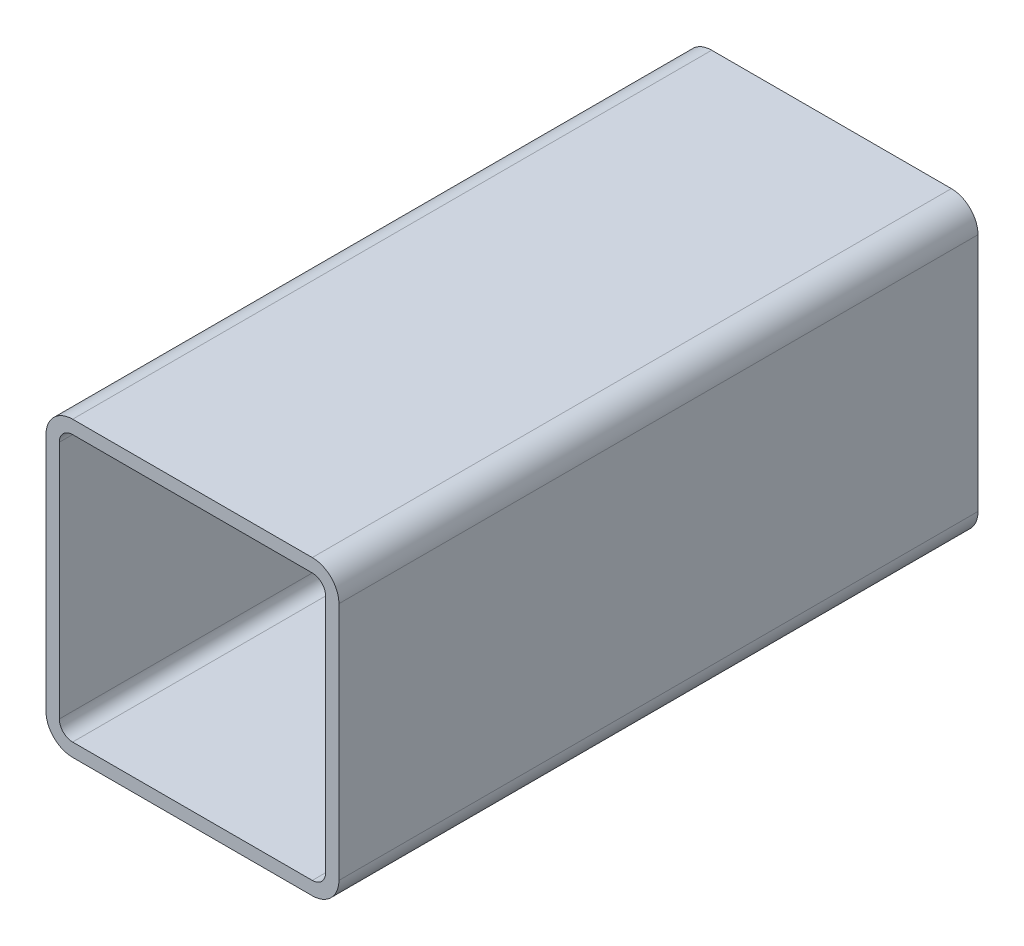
ISO-10303-21;
HEADER;
FILE_DESCRIPTION(('STEP AP214'),'2;1');
FILE_NAME('part.step','',(''),(''),'','','');
FILE_SCHEMA(('AUTOMOTIVE_DESIGN { 1 0 10303 214 1 1 1 1 }'));
ENDSEC;
DATA;
#1=APPLICATION_CONTEXT('core data for automotive mechanical design processes');
#2=APPLICATION_PROTOCOL_DEFINITION('international standard','automotive_design',2000,#1);
#3=PRODUCT_CONTEXT('',#1,'mechanical');
#4=PRODUCT('Part','Part','',(#3));
#5=PRODUCT_RELATED_PRODUCT_CATEGORY('part','',(#4));
#6=PRODUCT_DEFINITION_FORMATION('','',#4);
#7=PRODUCT_DEFINITION_CONTEXT('part definition',#1,'design');
#8=PRODUCT_DEFINITION('design','',#6,#7);
#9=PRODUCT_DEFINITION_SHAPE('','',#8);
#10=(LENGTH_UNIT() NAMED_UNIT(*) SI_UNIT(.MILLI.,.METRE.));
#11=(NAMED_UNIT(*) PLANE_ANGLE_UNIT() SI_UNIT($,.RADIAN.));
#12=(NAMED_UNIT(*) SI_UNIT($,.STERADIAN.) SOLID_ANGLE_UNIT());
#13=UNCERTAINTY_MEASURE_WITH_UNIT(LENGTH_MEASURE(1.E-05),#10,'distance_accuracy_value','');
#14=(GEOMETRIC_REPRESENTATION_CONTEXT(3) GLOBAL_UNCERTAINTY_ASSIGNED_CONTEXT((#13)) GLOBAL_UNIT_ASSIGNED_CONTEXT((#10,
#11,#12)) REPRESENTATION_CONTEXT('',''));
#15=CARTESIAN_POINT('',(0.,0.,0.));
#16=DIRECTION('',(0.,0.,1.));
#17=DIRECTION('',(1.,0.,0.));
#18=AXIS2_PLACEMENT_3D('',#15,#16,#17);
#19=CARTESIAN_POINT('',(13.1542705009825,127.755693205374,304.8));
#20=DIRECTION('',(0.,0.,1.));
#21=DIRECTION('',(1.,0.,0.));
#22=AXIS2_PLACEMENT_3D('',#19,#20,#21);
#23=PLANE('',#22);
#24=CARTESIAN_POINT('',(13.1542705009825,127.755693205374,304.8));
#25=DIRECTION('',(0.,0.,1.));
#26=DIRECTION('',(1.,0.,0.));
#27=AXIS2_PLACEMENT_3D('',#24,#25,#26);
#28=CIRCLE('',#27,12.7);
#29=CARTESIAN_POINT('',(13.1542705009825,140.455693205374,304.8));
#30=VERTEX_POINT('',#29);
#31=CARTESIAN_POINT('',(0.454270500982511,127.755693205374,304.8));
#32=VERTEX_POINT('',#31);
#33=EDGE_CURVE('E211',#30,#32,#28,.T.);
#34=ORIENTED_EDGE('',*,*,#33,.T.);
#35=DIRECTION('',(0.,-1.,0.));
#36=VECTOR('',#35,1.);
#37=CARTESIAN_POINT('',(0.454270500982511,13.4556932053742,304.8));
#38=LINE('',#37,#36);
#39=CARTESIAN_POINT('',(0.454270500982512,13.4556932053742,304.8));
#40=VERTEX_POINT('',#39);
#41=EDGE_CURVE('E214',#32,#40,#38,.T.);
#42=ORIENTED_EDGE('',*,*,#41,.T.);
#43=CARTESIAN_POINT('',(13.1542705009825,13.4556932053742,304.8));
#44=DIRECTION('',(0.,0.,1.));
#45=DIRECTION('',(1.,0.,0.));
#46=AXIS2_PLACEMENT_3D('',#43,#44,#45);
#47=CIRCLE('',#46,12.7);
#48=CARTESIAN_POINT('',(13.1542705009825,0.755693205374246,304.8));
#49=VERTEX_POINT('',#48);
#50=EDGE_CURVE('E217',#40,#49,#47,.T.);
#51=ORIENTED_EDGE('',*,*,#50,.T.);
#52=DIRECTION('',(1.,0.,0.));
#53=VECTOR('',#52,1.);
#54=CARTESIAN_POINT('',(127.454270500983,0.755693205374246,304.8));
#55=LINE('',#54,#53);
#56=CARTESIAN_POINT('',(127.454270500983,0.755693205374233,304.8));
#57=VERTEX_POINT('',#56);
#58=EDGE_CURVE('E219',#49,#57,#55,.T.);
#59=ORIENTED_EDGE('',*,*,#58,.T.);
#60=CARTESIAN_POINT('',(127.454270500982,13.4556932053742,304.8));
#61=DIRECTION('',(0.,0.,1.));
#62=DIRECTION('',(1.,0.,0.));
#63=AXIS2_PLACEMENT_3D('',#60,#61,#62);
#64=CIRCLE('',#63,12.7);
#65=CARTESIAN_POINT('',(140.154270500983,13.4556932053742,304.8));
#66=VERTEX_POINT('',#65);
#67=EDGE_CURVE('E221',#57,#66,#64,.T.);
#68=ORIENTED_EDGE('',*,*,#67,.T.);
#69=DIRECTION('',(0.,1.,0.));
#70=VECTOR('',#69,1.);
#71=CARTESIAN_POINT('',(140.154270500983,127.755693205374,304.8));
#72=LINE('',#71,#70);
#73=CARTESIAN_POINT('',(140.154270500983,127.755693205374,304.8));
#74=VERTEX_POINT('',#73);
#75=EDGE_CURVE('E223',#66,#74,#72,.T.);
#76=ORIENTED_EDGE('',*,*,#75,.T.);
#77=CARTESIAN_POINT('',(127.454270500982,127.755693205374,304.8));
#78=DIRECTION('',(0.,0.,1.));
#79=DIRECTION('',(1.,0.,0.));
#80=AXIS2_PLACEMENT_3D('',#77,#78,#79);
#81=CIRCLE('',#80,12.7);
#82=CARTESIAN_POINT('',(127.454270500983,140.455693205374,304.8));
#83=VERTEX_POINT('',#82);
#84=EDGE_CURVE('E225',#74,#83,#81,.T.);
#85=ORIENTED_EDGE('',*,*,#84,.T.);
#86=DIRECTION('',(-1.,0.,0.));
#87=VECTOR('',#86,1.);
#88=CARTESIAN_POINT('',(13.1542705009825,140.455693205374,304.8));
#89=LINE('',#88,#87);
#90=EDGE_CURVE('E227',#83,#30,#89,.T.);
#91=ORIENTED_EDGE('',*,*,#90,.T.);
#92=EDGE_LOOP('',(#34,#42,#51,#59,#68,#76,#85,#91));
#93=FACE_BOUND('',#92,.T.);
#94=DIRECTION('',(0.,-1.,0.));
#95=VECTOR('',#94,1.);
#96=CARTESIAN_POINT('',(6.80427050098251,13.4556932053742,304.8));
#97=LINE('',#96,#95);
#98=CARTESIAN_POINT('',(6.80427050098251,127.755693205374,304.8));
#99=VERTEX_POINT('',#98);
#100=CARTESIAN_POINT('',(6.80427050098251,13.4556932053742,304.8));
#101=VERTEX_POINT('',#100);
#102=EDGE_CURVE('E154',#99,#101,#97,.T.);
#103=ORIENTED_EDGE('',*,*,#102,.F.);
#104=CARTESIAN_POINT('',(13.1542705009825,127.755693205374,304.8));
#105=DIRECTION('',(0.,0.,1.));
#106=DIRECTION('',(1.,0.,0.));
#107=AXIS2_PLACEMENT_3D('',#104,#105,#106);
#108=CIRCLE('',#107,6.35);
#109=CARTESIAN_POINT('',(13.1542705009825,134.105693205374,304.8));
#110=VERTEX_POINT('',#109);
#111=EDGE_CURVE('E146',#110,#99,#108,.T.);
#112=ORIENTED_EDGE('',*,*,#111,.F.);
#113=DIRECTION('',(-1.,0.,0.));
#114=VECTOR('',#113,1.);
#115=CARTESIAN_POINT('',(13.1542705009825,134.105693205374,304.8));
#116=LINE('',#115,#114);
#117=CARTESIAN_POINT('',(127.454270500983,134.105693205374,304.8));
#118=VERTEX_POINT('',#117);
#119=EDGE_CURVE('E179',#118,#110,#116,.T.);
#120=ORIENTED_EDGE('',*,*,#119,.F.);
#121=CARTESIAN_POINT('',(127.454270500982,127.755693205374,304.8));
#122=DIRECTION('',(0.,0.,1.));
#123=DIRECTION('',(1.,0.,0.));
#124=AXIS2_PLACEMENT_3D('',#121,#122,#123);
#125=CIRCLE('',#124,6.35000000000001);
#126=CARTESIAN_POINT('',(133.804270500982,127.755693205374,304.8));
#127=VERTEX_POINT('',#126);
#128=EDGE_CURVE('E177',#127,#118,#125,.T.);
#129=ORIENTED_EDGE('',*,*,#128,.F.);
#130=DIRECTION('',(0.,1.,0.));
#131=VECTOR('',#130,1.);
#132=CARTESIAN_POINT('',(133.804270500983,127.755693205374,304.8));
#133=LINE('',#132,#131);
#134=CARTESIAN_POINT('',(133.804270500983,13.4556932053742,304.8));
#135=VERTEX_POINT('',#134);
#136=EDGE_CURVE('E175',#135,#127,#133,.T.);
#137=ORIENTED_EDGE('',*,*,#136,.F.);
#138=CARTESIAN_POINT('',(127.454270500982,13.4556932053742,304.8));
#139=DIRECTION('',(0.,0.,1.));
#140=DIRECTION('',(1.,0.,0.));
#141=AXIS2_PLACEMENT_3D('',#138,#139,#140);
#142=CIRCLE('',#141,6.35000000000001);
#143=CARTESIAN_POINT('',(127.454270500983,7.10569320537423,304.8));
#144=VERTEX_POINT('',#143);
#145=EDGE_CURVE('E173',#144,#135,#142,.T.);
#146=ORIENTED_EDGE('',*,*,#145,.F.);
#147=DIRECTION('',(1.,0.,0.));
#148=VECTOR('',#147,1.);
#149=CARTESIAN_POINT('',(127.454270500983,7.10569320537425,304.8));
#150=LINE('',#149,#148);
#151=CARTESIAN_POINT('',(13.1542705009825,7.10569320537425,304.8));
#152=VERTEX_POINT('',#151);
#153=EDGE_CURVE('E169',#152,#144,#150,.T.);
#154=ORIENTED_EDGE('',*,*,#153,.F.);
#155=CARTESIAN_POINT('',(13.1542705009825,13.4556932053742,304.8));
#156=DIRECTION('',(0.,0.,1.));
#157=DIRECTION('',(1.,0.,0.));
#158=AXIS2_PLACEMENT_3D('',#155,#156,#157);
#159=CIRCLE('',#158,6.35);
#160=EDGE_CURVE('E167',#101,#152,#159,.T.);
#161=ORIENTED_EDGE('',*,*,#160,.F.);
#162=EDGE_LOOP('',(#103,#112,#120,#129,#137,#146,#154,#161));
#163=FACE_BOUND('',#162,.T.);
#164=ADVANCED_FACE('F33',(#93,#163),#23,.T.);
#165=CARTESIAN_POINT('',(13.1542705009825,127.755693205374,0.));
#166=DIRECTION('',(0.,0.,1.));
#167=DIRECTION('',(1.,0.,0.));
#168=AXIS2_PLACEMENT_3D('',#165,#166,#167);
#169=PLANE('',#168);
#170=CARTESIAN_POINT('',(13.1542705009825,127.755693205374,0.));
#171=DIRECTION('',(0.,0.,1.));
#172=DIRECTION('',(1.,0.,0.));
#173=AXIS2_PLACEMENT_3D('',#170,#171,#172);
#174=CIRCLE('',#173,12.7);
#175=CARTESIAN_POINT('',(13.1542705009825,140.455693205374,0.));
#176=VERTEX_POINT('',#175);
#177=CARTESIAN_POINT('',(0.454270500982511,127.755693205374,0.));
#178=VERTEX_POINT('',#177);
#179=EDGE_CURVE('E162',#176,#178,#174,.T.);
#180=ORIENTED_EDGE('',*,*,#179,.F.);
#181=DIRECTION('',(-1.,0.,0.));
#182=VECTOR('',#181,1.);
#183=CARTESIAN_POINT('',(13.1542705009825,140.455693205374,0.));
#184=LINE('',#183,#182);
#185=CARTESIAN_POINT('',(127.454270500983,140.455693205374,0.));
#186=VERTEX_POINT('',#185);
#187=EDGE_CURVE('E215',#186,#176,#184,.T.);
#188=ORIENTED_EDGE('',*,*,#187,.F.);
#189=CARTESIAN_POINT('',(127.454270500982,127.755693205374,0.));
#190=DIRECTION('',(0.,0.,1.));
#191=DIRECTION('',(1.,0.,0.));
#192=AXIS2_PLACEMENT_3D('',#189,#190,#191);
#193=CIRCLE('',#192,12.7);
#194=CARTESIAN_POINT('',(140.154270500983,127.755693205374,0.));
#195=VERTEX_POINT('',#194);
#196=EDGE_CURVE('E242',#195,#186,#193,.T.);
#197=ORIENTED_EDGE('',*,*,#196,.F.);
#198=DIRECTION('',(0.,1.,0.));
#199=VECTOR('',#198,1.);
#200=CARTESIAN_POINT('',(140.154270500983,127.755693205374,0.));
#201=LINE('',#200,#199);
#202=CARTESIAN_POINT('',(140.154270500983,13.4556932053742,0.));
#203=VERTEX_POINT('',#202);
#204=EDGE_CURVE('E240',#203,#195,#201,.T.);
#205=ORIENTED_EDGE('',*,*,#204,.F.);
#206=CARTESIAN_POINT('',(127.454270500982,13.4556932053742,0.));
#207=DIRECTION('',(0.,0.,1.));
#208=DIRECTION('',(1.,0.,0.));
#209=AXIS2_PLACEMENT_3D('',#206,#207,#208);
#210=CIRCLE('',#209,12.7);
#211=CARTESIAN_POINT('',(127.454270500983,0.755693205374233,0.));
#212=VERTEX_POINT('',#211);
#213=EDGE_CURVE('E238',#212,#203,#210,.T.);
#214=ORIENTED_EDGE('',*,*,#213,.F.);
#215=DIRECTION('',(1.,0.,0.));
#216=VECTOR('',#215,1.);
#217=CARTESIAN_POINT('',(127.454270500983,0.755693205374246,0.));
#218=LINE('',#217,#216);
#219=CARTESIAN_POINT('',(13.1542705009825,0.755693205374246,0.));
#220=VERTEX_POINT('',#219);
#221=EDGE_CURVE('E236',#220,#212,#218,.T.);
#222=ORIENTED_EDGE('',*,*,#221,.F.);
#223=CARTESIAN_POINT('',(13.1542705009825,13.4556932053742,0.));
#224=DIRECTION('',(0.,0.,1.));
#225=DIRECTION('',(1.,0.,0.));
#226=AXIS2_PLACEMENT_3D('',#223,#224,#225);
#227=CIRCLE('',#226,12.7);
#228=CARTESIAN_POINT('',(0.454270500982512,13.4556932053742,0.));
#229=VERTEX_POINT('',#228);
#230=EDGE_CURVE('E234',#229,#220,#227,.T.);
#231=ORIENTED_EDGE('',*,*,#230,.F.);
#232=DIRECTION('',(0.,-1.,0.));
#233=VECTOR('',#232,1.);
#234=CARTESIAN_POINT('',(0.454270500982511,13.4556932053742,0.));
#235=LINE('',#234,#233);
#236=EDGE_CURVE('E232',#178,#229,#235,.T.);
#237=ORIENTED_EDGE('',*,*,#236,.F.);
#238=EDGE_LOOP('',(#180,#188,#197,#205,#214,#222,#231,#237));
#239=FACE_BOUND('',#238,.T.);
#240=CARTESIAN_POINT('',(13.1542705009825,127.755693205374,0.));
#241=DIRECTION('',(0.,0.,1.));
#242=DIRECTION('',(1.,0.,0.));
#243=AXIS2_PLACEMENT_3D('',#240,#241,#242);
#244=CIRCLE('',#243,6.35);
#245=CARTESIAN_POINT('',(13.1542705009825,134.105693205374,0.));
#246=VERTEX_POINT('',#245);
#247=CARTESIAN_POINT('',(6.80427050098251,127.755693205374,0.));
#248=VERTEX_POINT('',#247);
#249=EDGE_CURVE('E56',#246,#248,#244,.T.);
#250=ORIENTED_EDGE('',*,*,#249,.T.);
#251=DIRECTION('',(0.,-1.,0.));
#252=VECTOR('',#251,1.);
#253=CARTESIAN_POINT('',(6.80427050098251,13.4556932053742,0.));
#254=LINE('',#253,#252);
#255=CARTESIAN_POINT('',(6.80427050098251,13.4556932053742,0.));
#256=VERTEX_POINT('',#255);
#257=EDGE_CURVE('E161',#248,#256,#254,.T.);
#258=ORIENTED_EDGE('',*,*,#257,.T.);
#259=CARTESIAN_POINT('',(13.1542705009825,13.4556932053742,0.));
#260=DIRECTION('',(0.,0.,1.));
#261=DIRECTION('',(1.,0.,0.));
#262=AXIS2_PLACEMENT_3D('',#259,#260,#261);
#263=CIRCLE('',#262,6.35);
#264=CARTESIAN_POINT('',(13.1542705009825,7.10569320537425,0.));
#265=VERTEX_POINT('',#264);
#266=EDGE_CURVE('E183',#256,#265,#263,.T.);
#267=ORIENTED_EDGE('',*,*,#266,.T.);
#268=DIRECTION('',(1.,0.,0.));
#269=VECTOR('',#268,1.);
#270=CARTESIAN_POINT('',(127.454270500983,7.10569320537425,0.));
#271=LINE('',#270,#269);
#272=CARTESIAN_POINT('',(127.454270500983,7.10569320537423,0.));
#273=VERTEX_POINT('',#272);
#274=EDGE_CURVE('E186',#265,#273,#271,.T.);
#275=ORIENTED_EDGE('',*,*,#274,.T.);
#276=CARTESIAN_POINT('',(127.454270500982,13.4556932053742,0.));
#277=DIRECTION('',(0.,0.,1.));
#278=DIRECTION('',(1.,0.,0.));
#279=AXIS2_PLACEMENT_3D('',#276,#277,#278);
#280=CIRCLE('',#279,6.35000000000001);
#281=CARTESIAN_POINT('',(133.804270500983,13.4556932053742,0.));
#282=VERTEX_POINT('',#281);
#283=EDGE_CURVE('E189',#273,#282,#280,.T.);
#284=ORIENTED_EDGE('',*,*,#283,.T.);
#285=DIRECTION('',(0.,1.,0.));
#286=VECTOR('',#285,1.);
#287=CARTESIAN_POINT('',(133.804270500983,127.755693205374,0.));
#288=LINE('',#287,#286);
#289=CARTESIAN_POINT('',(133.804270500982,127.755693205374,0.));
#290=VERTEX_POINT('',#289);
#291=EDGE_CURVE('E192',#282,#290,#288,.T.);
#292=ORIENTED_EDGE('',*,*,#291,.T.);
#293=CARTESIAN_POINT('',(127.454270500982,127.755693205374,0.));
#294=DIRECTION('',(0.,0.,1.));
#295=DIRECTION('',(1.,0.,0.));
#296=AXIS2_PLACEMENT_3D('',#293,#294,#295);
#297=CIRCLE('',#296,6.35000000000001);
#298=CARTESIAN_POINT('',(127.454270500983,134.105693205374,0.));
#299=VERTEX_POINT('',#298);
#300=EDGE_CURVE('E195',#290,#299,#297,.T.);
#301=ORIENTED_EDGE('',*,*,#300,.T.);
#302=DIRECTION('',(-1.,0.,0.));
#303=VECTOR('',#302,1.);
#304=CARTESIAN_POINT('',(13.1542705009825,134.105693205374,0.));
#305=LINE('',#304,#303);
#306=EDGE_CURVE('E155',#299,#246,#305,.T.);
#307=ORIENTED_EDGE('',*,*,#306,.T.);
#308=EDGE_LOOP('',(#250,#258,#267,#275,#284,#292,#301,#307));
#309=FACE_BOUND('',#308,.T.);
#310=ADVANCED_FACE('F272',(#239,#309),#169,.F.);
#311=CARTESIAN_POINT('',(13.1542705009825,127.755693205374,304.8));
#312=DIRECTION('',(0.,0.,-1.));
#313=DIRECTION('',(-1.,0.,0.));
#314=AXIS2_PLACEMENT_3D('',#311,#312,#313);
#315=CYLINDRICAL_SURFACE('',#314,12.7);
#316=ORIENTED_EDGE('',*,*,#179,.T.);
#317=DIRECTION('',(0.,0.,-1.));
#318=VECTOR('',#317,1.);
#319=CARTESIAN_POINT('',(0.454270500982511,127.755693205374,304.8));
#320=LINE('',#319,#318);
#321=EDGE_CURVE('E11',#32,#178,#320,.T.);
#322=ORIENTED_EDGE('',*,*,#321,.F.);
#323=ORIENTED_EDGE('',*,*,#33,.F.);
#324=DIRECTION('',(0.,0.,-1.));
#325=VECTOR('',#324,1.);
#326=CARTESIAN_POINT('',(13.1542705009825,140.455693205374,304.8));
#327=LINE('',#326,#325);
#328=EDGE_CURVE('E229',#30,#176,#327,.T.);
#329=ORIENTED_EDGE('',*,*,#328,.T.);
#330=EDGE_LOOP('',(#316,#322,#323,#329));
#331=FACE_BOUND('',#330,.T.);
#332=ADVANCED_FACE('F35',(#331),#315,.T.);
#333=CARTESIAN_POINT('',(0.454270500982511,13.4556932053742,304.8));
#334=DIRECTION('',(1.,0.,0.));
#335=DIRECTION('',(0.,0.,-1.));
#336=AXIS2_PLACEMENT_3D('',#333,#334,#335);
#337=PLANE('',#336);
#338=ORIENTED_EDGE('',*,*,#236,.T.);
#339=DIRECTION('',(0.,0.,-1.));
#340=VECTOR('',#339,1.);
#341=CARTESIAN_POINT('',(0.454270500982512,13.4556932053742,304.8));
#342=LINE('',#341,#340);
#343=EDGE_CURVE('E41',#40,#229,#342,.T.);
#344=ORIENTED_EDGE('',*,*,#343,.F.);
#345=ORIENTED_EDGE('',*,*,#41,.F.);
#346=ORIENTED_EDGE('',*,*,#321,.T.);
#347=EDGE_LOOP('',(#338,#344,#345,#346));
#348=FACE_BOUND('',#347,.T.);
#349=ADVANCED_FACE('F289',(#348),#337,.F.);
#350=CARTESIAN_POINT('',(13.1542705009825,13.4556932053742,304.8));
#351=DIRECTION('',(0.,0.,-1.));
#352=DIRECTION('',(-1.,0.,0.));
#353=AXIS2_PLACEMENT_3D('',#350,#351,#352);
#354=CYLINDRICAL_SURFACE('',#353,12.7);
#355=ORIENTED_EDGE('',*,*,#230,.T.);
#356=DIRECTION('',(0.,0.,-1.));
#357=VECTOR('',#356,1.);
#358=CARTESIAN_POINT('',(13.1542705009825,0.755693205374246,304.8));
#359=LINE('',#358,#357);
#360=EDGE_CURVE('E259',#49,#220,#359,.T.);
#361=ORIENTED_EDGE('',*,*,#360,.F.);
#362=ORIENTED_EDGE('',*,*,#50,.F.);
#363=ORIENTED_EDGE('',*,*,#343,.T.);
#364=EDGE_LOOP('',(#355,#361,#362,#363));
#365=FACE_BOUND('',#364,.T.);
#366=ADVANCED_FACE('F266',(#365),#354,.T.);
#367=CARTESIAN_POINT('',(127.454270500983,0.755693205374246,304.8));
#368=DIRECTION('',(0.,1.,0.));
#369=DIRECTION('',(0.,0.,1.));
#370=AXIS2_PLACEMENT_3D('',#367,#368,#369);
#371=PLANE('',#370);
#372=ORIENTED_EDGE('',*,*,#221,.T.);
#373=DIRECTION('',(0.,0.,-1.));
#374=VECTOR('',#373,1.);
#375=CARTESIAN_POINT('',(127.454270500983,0.755693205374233,304.8));
#376=LINE('',#375,#374);
#377=EDGE_CURVE('E256',#57,#212,#376,.T.);
#378=ORIENTED_EDGE('',*,*,#377,.F.);
#379=ORIENTED_EDGE('',*,*,#58,.F.);
#380=ORIENTED_EDGE('',*,*,#360,.T.);
#381=EDGE_LOOP('',(#372,#378,#379,#380));
#382=FACE_BOUND('',#381,.T.);
#383=ADVANCED_FACE('F278',(#382),#371,.F.);
#384=CARTESIAN_POINT('',(127.454270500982,13.4556932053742,304.8));
#385=DIRECTION('',(0.,0.,-1.));
#386=DIRECTION('',(-1.,0.,0.));
#387=AXIS2_PLACEMENT_3D('',#384,#385,#386);
#388=CYLINDRICAL_SURFACE('',#387,12.7);
#389=ORIENTED_EDGE('',*,*,#213,.T.);
#390=DIRECTION('',(0.,0.,-1.));
#391=VECTOR('',#390,1.);
#392=CARTESIAN_POINT('',(140.154270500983,13.4556932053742,304.8));
#393=LINE('',#392,#391);
#394=EDGE_CURVE('E253',#66,#203,#393,.T.);
#395=ORIENTED_EDGE('',*,*,#394,.F.);
#396=ORIENTED_EDGE('',*,*,#67,.F.);
#397=ORIENTED_EDGE('',*,*,#377,.T.);
#398=EDGE_LOOP('',(#389,#395,#396,#397));
#399=FACE_BOUND('',#398,.T.);
#400=ADVANCED_FACE('F282',(#399),#388,.T.);
#401=CARTESIAN_POINT('',(140.154270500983,127.755693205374,304.8));
#402=DIRECTION('',(-1.,0.,0.));
#403=DIRECTION('',(0.,0.,1.));
#404=AXIS2_PLACEMENT_3D('',#401,#402,#403);
#405=PLANE('',#404);
#406=ORIENTED_EDGE('',*,*,#204,.T.);
#407=DIRECTION('',(0.,0.,-1.));
#408=VECTOR('',#407,1.);
#409=CARTESIAN_POINT('',(140.154270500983,127.755693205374,304.8));
#410=LINE('',#409,#408);
#411=EDGE_CURVE('E250',#74,#195,#410,.T.);
#412=ORIENTED_EDGE('',*,*,#411,.F.);
#413=ORIENTED_EDGE('',*,*,#75,.F.);
#414=ORIENTED_EDGE('',*,*,#394,.T.);
#415=EDGE_LOOP('',(#406,#412,#413,#414));
#416=FACE_BOUND('',#415,.T.);
#417=ADVANCED_FACE('F302',(#416),#405,.F.);
#418=CARTESIAN_POINT('',(127.454270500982,127.755693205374,304.8));
#419=DIRECTION('',(0.,0.,-1.));
#420=DIRECTION('',(-1.,0.,0.));
#421=AXIS2_PLACEMENT_3D('',#418,#419,#420);
#422=CYLINDRICAL_SURFACE('',#421,12.7);
#423=ORIENTED_EDGE('',*,*,#196,.T.);
#424=DIRECTION('',(0.,0.,-1.));
#425=VECTOR('',#424,1.);
#426=CARTESIAN_POINT('',(127.454270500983,140.455693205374,304.8));
#427=LINE('',#426,#425);
#428=EDGE_CURVE('E247',#83,#186,#427,.T.);
#429=ORIENTED_EDGE('',*,*,#428,.F.);
#430=ORIENTED_EDGE('',*,*,#84,.F.);
#431=ORIENTED_EDGE('',*,*,#411,.T.);
#432=EDGE_LOOP('',(#423,#429,#430,#431));
#433=FACE_BOUND('',#432,.T.);
#434=ADVANCED_FACE('F300',(#433),#422,.T.);
#435=CARTESIAN_POINT('',(13.1542705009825,140.455693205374,304.8));
#436=DIRECTION('',(0.,-1.,0.));
#437=DIRECTION('',(0.,0.,-1.));
#438=AXIS2_PLACEMENT_3D('',#435,#436,#437);
#439=PLANE('',#438);
#440=ORIENTED_EDGE('',*,*,#187,.T.);
#441=ORIENTED_EDGE('',*,*,#328,.F.);
#442=ORIENTED_EDGE('',*,*,#90,.F.);
#443=ORIENTED_EDGE('',*,*,#428,.T.);
#444=EDGE_LOOP('',(#440,#441,#442,#443));
#445=FACE_BOUND('',#444,.T.);
#446=ADVANCED_FACE('F295',(#445),#439,.F.);
#447=CARTESIAN_POINT('',(13.1542705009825,127.755693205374,304.8));
#448=DIRECTION('',(0.,0.,-1.));
#449=DIRECTION('',(-1.,0.,0.));
#450=AXIS2_PLACEMENT_3D('',#447,#448,#449);
#451=CYLINDRICAL_SURFACE('',#450,6.35);
#452=ORIENTED_EDGE('',*,*,#249,.F.);
#453=DIRECTION('',(0.,0.,-1.));
#454=VECTOR('',#453,1.);
#455=CARTESIAN_POINT('',(13.1542705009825,134.105693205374,304.8));
#456=LINE('',#455,#454);
#457=EDGE_CURVE('E150',#110,#246,#456,.T.);
#458=ORIENTED_EDGE('',*,*,#457,.F.);
#459=ORIENTED_EDGE('',*,*,#111,.T.);
#460=DIRECTION('',(0.,0.,-1.));
#461=VECTOR('',#460,1.);
#462=CARTESIAN_POINT('',(6.80427050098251,127.755693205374,304.8));
#463=LINE('',#462,#461);
#464=EDGE_CURVE('E149',#99,#248,#463,.T.);
#465=ORIENTED_EDGE('',*,*,#464,.T.);
#466=EDGE_LOOP('',(#452,#458,#459,#465));
#467=FACE_BOUND('',#466,.T.);
#468=ADVANCED_FACE('F148',(#467),#451,.F.);
#469=CARTESIAN_POINT('',(6.80427050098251,13.4556932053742,304.8));
#470=DIRECTION('',(1.,0.,0.));
#471=DIRECTION('',(0.,0.,-1.));
#472=AXIS2_PLACEMENT_3D('',#469,#470,#471);
#473=PLANE('',#472);
#474=ORIENTED_EDGE('',*,*,#257,.F.);
#475=ORIENTED_EDGE('',*,*,#464,.F.);
#476=ORIENTED_EDGE('',*,*,#102,.T.);
#477=DIRECTION('',(0.,0.,-1.));
#478=VECTOR('',#477,1.);
#479=CARTESIAN_POINT('',(6.80427050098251,13.4556932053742,304.8));
#480=LINE('',#479,#478);
#481=EDGE_CURVE('E163',#101,#256,#480,.T.);
#482=ORIENTED_EDGE('',*,*,#481,.T.);
#483=EDGE_LOOP('',(#474,#475,#476,#482));
#484=FACE_BOUND('',#483,.T.);
#485=ADVANCED_FACE('F158',(#484),#473,.T.);
#486=CARTESIAN_POINT('',(13.1542705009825,13.4556932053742,304.8));
#487=DIRECTION('',(0.,0.,-1.));
#488=DIRECTION('',(-1.,0.,0.));
#489=AXIS2_PLACEMENT_3D('',#486,#487,#488);
#490=CYLINDRICAL_SURFACE('',#489,6.35);
#491=ORIENTED_EDGE('',*,*,#266,.F.);
#492=ORIENTED_EDGE('',*,*,#481,.F.);
#493=ORIENTED_EDGE('',*,*,#160,.T.);
#494=DIRECTION('',(0.,0.,-1.));
#495=VECTOR('',#494,1.);
#496=CARTESIAN_POINT('',(13.1542705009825,7.10569320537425,304.8));
#497=LINE('',#496,#495);
#498=EDGE_CURVE('E208',#152,#265,#497,.T.);
#499=ORIENTED_EDGE('',*,*,#498,.T.);
#500=EDGE_LOOP('',(#491,#492,#493,#499));
#501=FACE_BOUND('',#500,.T.);
#502=ADVANCED_FACE('F327',(#501),#490,.F.);
#503=CARTESIAN_POINT('',(127.454270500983,7.10569320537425,304.8));
#504=DIRECTION('',(0.,1.,0.));
#505=DIRECTION('',(0.,0.,1.));
#506=AXIS2_PLACEMENT_3D('',#503,#504,#505);
#507=PLANE('',#506);
#508=ORIENTED_EDGE('',*,*,#274,.F.);
#509=ORIENTED_EDGE('',*,*,#498,.F.);
#510=ORIENTED_EDGE('',*,*,#153,.T.);
#511=DIRECTION('',(0.,0.,-1.));
#512=VECTOR('',#511,1.);
#513=CARTESIAN_POINT('',(127.454270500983,7.10569320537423,304.8));
#514=LINE('',#513,#512);
#515=EDGE_CURVE('E206',#144,#273,#514,.T.);
#516=ORIENTED_EDGE('',*,*,#515,.T.);
#517=EDGE_LOOP('',(#508,#509,#510,#516));
#518=FACE_BOUND('',#517,.T.);
#519=ADVANCED_FACE('F331',(#518),#507,.T.);
#520=CARTESIAN_POINT('',(127.454270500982,13.4556932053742,304.8));
#521=DIRECTION('',(0.,0.,-1.));
#522=DIRECTION('',(-1.,0.,0.));
#523=AXIS2_PLACEMENT_3D('',#520,#521,#522);
#524=CYLINDRICAL_SURFACE('',#523,6.35000000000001);
#525=ORIENTED_EDGE('',*,*,#283,.F.);
#526=ORIENTED_EDGE('',*,*,#515,.F.);
#527=ORIENTED_EDGE('',*,*,#145,.T.);
#528=DIRECTION('',(0.,0.,-1.));
#529=VECTOR('',#528,1.);
#530=CARTESIAN_POINT('',(133.804270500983,13.4556932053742,304.8));
#531=LINE('',#530,#529);
#532=EDGE_CURVE('E204',#135,#282,#531,.T.);
#533=ORIENTED_EDGE('',*,*,#532,.T.);
#534=EDGE_LOOP('',(#525,#526,#527,#533));
#535=FACE_BOUND('',#534,.T.);
#536=ADVANCED_FACE('F337',(#535),#524,.F.);
#537=CARTESIAN_POINT('',(133.804270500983,127.755693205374,304.8));
#538=DIRECTION('',(-1.,0.,0.));
#539=DIRECTION('',(0.,0.,1.));
#540=AXIS2_PLACEMENT_3D('',#537,#538,#539);
#541=PLANE('',#540);
#542=ORIENTED_EDGE('',*,*,#291,.F.);
#543=ORIENTED_EDGE('',*,*,#532,.F.);
#544=ORIENTED_EDGE('',*,*,#136,.T.);
#545=DIRECTION('',(0.,0.,-1.));
#546=VECTOR('',#545,1.);
#547=CARTESIAN_POINT('',(133.804270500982,127.755693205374,304.8));
#548=LINE('',#547,#546);
#549=EDGE_CURVE('E202',#127,#290,#548,.T.);
#550=ORIENTED_EDGE('',*,*,#549,.T.);
#551=EDGE_LOOP('',(#542,#543,#544,#550));
#552=FACE_BOUND('',#551,.T.);
#553=ADVANCED_FACE('F341',(#552),#541,.T.);
#554=CARTESIAN_POINT('',(127.454270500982,127.755693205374,304.8));
#555=DIRECTION('',(0.,0.,-1.));
#556=DIRECTION('',(-1.,0.,0.));
#557=AXIS2_PLACEMENT_3D('',#554,#555,#556);
#558=CYLINDRICAL_SURFACE('',#557,6.35000000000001);
#559=ORIENTED_EDGE('',*,*,#300,.F.);
#560=ORIENTED_EDGE('',*,*,#549,.F.);
#561=ORIENTED_EDGE('',*,*,#128,.T.);
#562=DIRECTION('',(0.,0.,-1.));
#563=VECTOR('',#562,1.);
#564=CARTESIAN_POINT('',(127.454270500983,134.105693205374,304.8));
#565=LINE('',#564,#563);
#566=EDGE_CURVE('E48',#118,#299,#565,.T.);
#567=ORIENTED_EDGE('',*,*,#566,.T.);
#568=EDGE_LOOP('',(#559,#560,#561,#567));
#569=FACE_BOUND('',#568,.T.);
#570=ADVANCED_FACE('F345',(#569),#558,.F.);
#571=CARTESIAN_POINT('',(13.1542705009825,134.105693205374,304.8));
#572=DIRECTION('',(0.,-1.,0.));
#573=DIRECTION('',(0.,0.,-1.));
#574=AXIS2_PLACEMENT_3D('',#571,#572,#573);
#575=PLANE('',#574);
#576=ORIENTED_EDGE('',*,*,#306,.F.);
#577=ORIENTED_EDGE('',*,*,#566,.F.);
#578=ORIENTED_EDGE('',*,*,#119,.T.);
#579=ORIENTED_EDGE('',*,*,#457,.T.);
#580=EDGE_LOOP('',(#576,#577,#578,#579));
#581=FACE_BOUND('',#580,.T.);
#582=ADVANCED_FACE('F349',(#581),#575,.T.);
#583=CLOSED_SHELL('',(#164,#310,#332,#349,#366,#383,#400,#417,#434,#446,#468,#485,#502,#519,
#536,#553,#570,#582));
#584=MANIFOLD_SOLID_BREP('B2',#583);
#585=ADVANCED_BREP_SHAPE_REPRESENTATION('',(#18,#584),#14);
#586=SHAPE_DEFINITION_REPRESENTATION(#9,#585);
ENDSEC;
END-ISO-10303-21;
